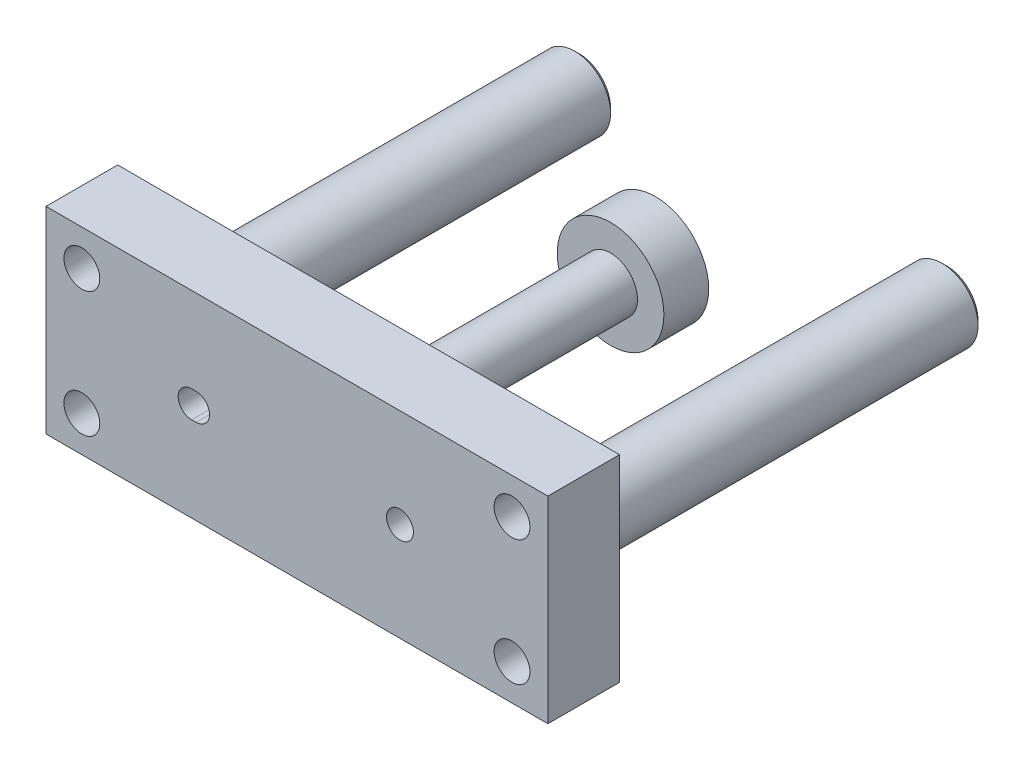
ISO-10303-21;
HEADER;
FILE_DESCRIPTION(('STEP AP214'),'2;1');
FILE_NAME('part.step','',(''),(''),'','','');
FILE_SCHEMA(('AUTOMOTIVE_DESIGN { 1 0 10303 214 1 1 1 1 }'));
ENDSEC;
DATA;
#1=APPLICATION_CONTEXT('core data for automotive mechanical design processes');
#2=APPLICATION_PROTOCOL_DEFINITION('international standard','automotive_design',2000,#1);
#3=PRODUCT_CONTEXT('',#1,'mechanical');
#4=PRODUCT('Part','Part','',(#3));
#5=PRODUCT_RELATED_PRODUCT_CATEGORY('part','',(#4));
#6=PRODUCT_DEFINITION_FORMATION('','',#4);
#7=PRODUCT_DEFINITION_CONTEXT('part definition',#1,'design');
#8=PRODUCT_DEFINITION('design','',#6,#7);
#9=PRODUCT_DEFINITION_SHAPE('','',#8);
#10=(LENGTH_UNIT() NAMED_UNIT(*) SI_UNIT(.MILLI.,.METRE.));
#11=(NAMED_UNIT(*) PLANE_ANGLE_UNIT() SI_UNIT($,.RADIAN.));
#12=(NAMED_UNIT(*) SI_UNIT($,.STERADIAN.) SOLID_ANGLE_UNIT());
#13=UNCERTAINTY_MEASURE_WITH_UNIT(LENGTH_MEASURE(1.E-05),#10,'distance_accuracy_value','');
#14=(GEOMETRIC_REPRESENTATION_CONTEXT(3) GLOBAL_UNCERTAINTY_ASSIGNED_CONTEXT((#13)) GLOBAL_UNIT_ASSIGNED_CONTEXT((#10,
#11,#12)) REPRESENTATION_CONTEXT('',''));
#15=CARTESIAN_POINT('',(0.,0.,0.));
#16=DIRECTION('',(0.,0.,1.));
#17=DIRECTION('',(1.,0.,0.));
#18=AXIS2_PLACEMENT_3D('',#15,#16,#17);
#19=CARTESIAN_POINT('',(-28.,-11.,29.5));
#20=DIRECTION('',(0.,0.,1.));
#21=DIRECTION('',(1.,0.,0.));
#22=AXIS2_PLACEMENT_3D('',#19,#20,#21);
#23=PLANE('',#22);
#24=CARTESIAN_POINT('',(-24.,-7.,29.5));
#25=DIRECTION('',(0.,0.,1.));
#26=DIRECTION('',(1.,0.,0.));
#27=AXIS2_PLACEMENT_3D('',#24,#25,#26);
#28=CIRCLE('',#27,2.);
#29=CARTESIAN_POINT('',(-22.,-7.,29.5));
#30=VERTEX_POINT('',#29);
#31=EDGE_CURVE('E411',#30,#30,#28,.T.);
#32=ORIENTED_EDGE('',*,*,#31,.T.);
#33=EDGE_LOOP('',(#32));
#34=FACE_BOUND('',#33,.T.);
#35=CARTESIAN_POINT('',(24.,-7.,29.5));
#36=DIRECTION('',(0.,0.,1.));
#37=DIRECTION('',(1.,0.,0.));
#38=AXIS2_PLACEMENT_3D('',#35,#36,#37);
#39=CIRCLE('',#38,2.);
#40=CARTESIAN_POINT('',(26.,-7.,29.5));
#41=VERTEX_POINT('',#40);
#42=EDGE_CURVE('E415',#41,#41,#39,.T.);
#43=ORIENTED_EDGE('',*,*,#42,.T.);
#44=EDGE_LOOP('',(#43));
#45=FACE_BOUND('',#44,.T.);
#46=CARTESIAN_POINT('',(-24.,7.,29.5));
#47=DIRECTION('',(0.,0.,1.));
#48=DIRECTION('',(1.,0.,0.));
#49=AXIS2_PLACEMENT_3D('',#46,#47,#48);
#50=CIRCLE('',#49,2.);
#51=CARTESIAN_POINT('',(-22.,7.,29.5));
#52=VERTEX_POINT('',#51);
#53=EDGE_CURVE('E424',#52,#52,#50,.T.);
#54=ORIENTED_EDGE('',*,*,#53,.T.);
#55=EDGE_LOOP('',(#54));
#56=FACE_BOUND('',#55,.T.);
#57=CARTESIAN_POINT('',(24.,7.,29.5));
#58=DIRECTION('',(0.,0.,1.));
#59=DIRECTION('',(1.,0.,0.));
#60=AXIS2_PLACEMENT_3D('',#57,#58,#59);
#61=CIRCLE('',#60,2.);
#62=CARTESIAN_POINT('',(26.,7.,29.5));
#63=VERTEX_POINT('',#62);
#64=EDGE_CURVE('E128',#63,#63,#61,.T.);
#65=ORIENTED_EDGE('',*,*,#64,.T.);
#66=EDGE_LOOP('',(#65));
#67=FACE_BOUND('',#66,.T.);
#68=CARTESIAN_POINT('',(20.5,0.,29.5));
#69=DIRECTION('',(0.,0.,1.));
#70=DIRECTION('',(1.,0.,0.));
#71=AXIS2_PLACEMENT_3D('',#68,#69,#70);
#72=CIRCLE('',#71,4.);
#73=CARTESIAN_POINT('',(24.5,0.,29.5));
#74=VERTEX_POINT('',#73);
#75=EDGE_CURVE('E199',#74,#74,#72,.F.);
#76=ORIENTED_EDGE('',*,*,#75,.F.);
#77=EDGE_LOOP('',(#76));
#78=FACE_BOUND('',#77,.T.);
#79=DIRECTION('',(0.,-1.,0.));
#80=VECTOR('',#79,1.);
#81=CARTESIAN_POINT('',(-28.,11.,29.5));
#82=LINE('',#81,#80);
#83=CARTESIAN_POINT('',(-28.,11.,29.5));
#84=VERTEX_POINT('',#83);
#85=CARTESIAN_POINT('',(-28.,-11.,29.5));
#86=VERTEX_POINT('',#85);
#87=EDGE_CURVE('E161',#84,#86,#82,.T.);
#88=ORIENTED_EDGE('',*,*,#87,.F.);
#89=DIRECTION('',(-1.,0.,0.));
#90=VECTOR('',#89,1.);
#91=CARTESIAN_POINT('',(-28.,11.,29.5));
#92=LINE('',#91,#90);
#93=CARTESIAN_POINT('',(28.,11.,29.5));
#94=VERTEX_POINT('',#93);
#95=EDGE_CURVE('E168',#94,#84,#92,.T.);
#96=ORIENTED_EDGE('',*,*,#95,.F.);
#97=DIRECTION('',(0.,1.,0.));
#98=VECTOR('',#97,1.);
#99=CARTESIAN_POINT('',(28.,11.,29.5));
#100=LINE('',#99,#98);
#101=CARTESIAN_POINT('',(28.,-11.,29.5));
#102=VERTEX_POINT('',#101);
#103=EDGE_CURVE('E166',#102,#94,#100,.T.);
#104=ORIENTED_EDGE('',*,*,#103,.F.);
#105=DIRECTION('',(1.,0.,0.));
#106=VECTOR('',#105,1.);
#107=CARTESIAN_POINT('',(-28.,-11.,29.5));
#108=LINE('',#107,#106);
#109=EDGE_CURVE('E164',#86,#102,#108,.T.);
#110=ORIENTED_EDGE('',*,*,#109,.F.);
#111=EDGE_LOOP('',(#88,#96,#104,#110));
#112=FACE_BOUND('',#111,.T.);
#113=CARTESIAN_POINT('',(0.,0.,29.5));
#114=DIRECTION('',(0.,0.,1.));
#115=DIRECTION('',(1.,0.,0.));
#116=AXIS2_PLACEMENT_3D('',#113,#114,#115);
#117=CIRCLE('',#116,3.);
#118=CARTESIAN_POINT('',(3.,0.,29.5));
#119=VERTEX_POINT('',#118);
#120=EDGE_CURVE('E189',#119,#119,#117,.T.);
#121=ORIENTED_EDGE('',*,*,#120,.T.);
#122=EDGE_LOOP('',(#121));
#123=FACE_BOUND('',#122,.T.);
#124=CARTESIAN_POINT('',(-20.5,0.,29.5));
#125=DIRECTION('',(0.,0.,1.));
#126=DIRECTION('',(1.,0.,0.));
#127=AXIS2_PLACEMENT_3D('',#124,#125,#126);
#128=CIRCLE('',#127,4.);
#129=CARTESIAN_POINT('',(-16.5,0.,29.5));
#130=VERTEX_POINT('',#129);
#131=EDGE_CURVE('E204',#130,#130,#128,.F.);
#132=ORIENTED_EDGE('',*,*,#131,.F.);
#133=EDGE_LOOP('',(#132));
#134=FACE_BOUND('',#133,.T.);
#135=ADVANCED_FACE('F31',(#34,#45,#56,#67,#78,#112,#123,#134),#23,.F.);
#136=CARTESIAN_POINT('',(0.,0.,2.5));
#137=DIRECTION('',(0.,0.,1.));
#138=DIRECTION('',(1.,0.,0.));
#139=AXIS2_PLACEMENT_3D('',#136,#137,#138);
#140=PLANE('',#139);
#141=CARTESIAN_POINT('',(0.,0.,2.5));
#142=DIRECTION('',(0.,0.,1.));
#143=DIRECTION('',(1.,0.,0.));
#144=AXIS2_PLACEMENT_3D('',#141,#142,#143);
#145=CIRCLE('',#144,5.95);
#146=CARTESIAN_POINT('',(5.95,0.,2.5));
#147=VERTEX_POINT('',#146);
#148=EDGE_CURVE('E196',#147,#147,#145,.T.);
#149=ORIENTED_EDGE('',*,*,#148,.T.);
#150=EDGE_LOOP('',(#149));
#151=FACE_BOUND('',#150,.T.);
#152=CARTESIAN_POINT('',(0.,0.,2.5));
#153=DIRECTION('',(0.,0.,1.));
#154=DIRECTION('',(1.,0.,0.));
#155=AXIS2_PLACEMENT_3D('',#152,#153,#154);
#156=CIRCLE('',#155,3.);
#157=CARTESIAN_POINT('',(3.,0.,2.5));
#158=VERTEX_POINT('',#157);
#159=EDGE_CURVE('E192',#158,#158,#156,.F.);
#160=ORIENTED_EDGE('',*,*,#159,.T.);
#161=EDGE_LOOP('',(#160));
#162=FACE_BOUND('',#161,.T.);
#163=ADVANCED_FACE('F238',(#151,#162),#140,.T.);
#164=CARTESIAN_POINT('',(0.,0.,2.5));
#165=DIRECTION('',(0.,0.,-1.));
#166=DIRECTION('',(-1.,0.,0.));
#167=AXIS2_PLACEMENT_3D('',#164,#165,#166);
#168=CYLINDRICAL_SURFACE('',#167,5.95);
#169=ORIENTED_EDGE('',*,*,#148,.F.);
#170=EDGE_LOOP('',(#169));
#171=FACE_BOUND('',#170,.T.);
#172=CARTESIAN_POINT('',(0.,0.,-2.5));
#173=DIRECTION('',(0.,0.,1.));
#174=DIRECTION('',(1.,0.,0.));
#175=AXIS2_PLACEMENT_3D('',#172,#173,#174);
#176=CIRCLE('',#175,5.95);
#177=CARTESIAN_POINT('',(5.95,0.,-2.5));
#178=VERTEX_POINT('',#177);
#179=EDGE_CURVE('E193',#178,#178,#176,.T.);
#180=ORIENTED_EDGE('',*,*,#179,.T.);
#181=EDGE_LOOP('',(#180));
#182=FACE_BOUND('',#181,.T.);
#183=ADVANCED_FACE('F33',(#171,#182),#168,.T.);
#184=CARTESIAN_POINT('',(0.,0.,-2.5));
#185=DIRECTION('',(0.,0.,1.));
#186=DIRECTION('',(1.,0.,0.));
#187=AXIS2_PLACEMENT_3D('',#184,#185,#186);
#188=PLANE('',#187);
#189=ORIENTED_EDGE('',*,*,#179,.F.);
#190=EDGE_LOOP('',(#189));
#191=FACE_BOUND('',#190,.T.);
#192=ADVANCED_FACE('F274',(#191),#188,.F.);
#193=CARTESIAN_POINT('',(0.,0.,37.9852813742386));
#194=DIRECTION('',(0.,0.,-1.));
#195=DIRECTION('',(-1.,0.,0.));
#196=AXIS2_PLACEMENT_3D('',#193,#194,#195);
#197=CYLINDRICAL_SURFACE('',#196,3.);
#198=ORIENTED_EDGE('',*,*,#159,.F.);
#199=EDGE_LOOP('',(#198));
#200=FACE_BOUND('',#199,.T.);
#201=ORIENTED_EDGE('',*,*,#120,.F.);
#202=EDGE_LOOP('',(#201));
#203=FACE_BOUND('',#202,.T.);
#204=ADVANCED_FACE('F270',(#200,#203),#197,.T.);
#205=CARTESIAN_POINT('',(-28.,11.,37.5));
#206=DIRECTION('',(1.,0.,0.));
#207=DIRECTION('',(0.,0.,-1.));
#208=AXIS2_PLACEMENT_3D('',#205,#206,#207);
#209=PLANE('',#208);
#210=ORIENTED_EDGE('',*,*,#87,.T.);
#211=DIRECTION('',(0.,0.,-1.));
#212=VECTOR('',#211,1.);
#213=CARTESIAN_POINT('',(-28.,-11.,37.5));
#214=LINE('',#213,#212);
#215=CARTESIAN_POINT('',(-28.,-11.,37.5));
#216=VERTEX_POINT('',#215);
#217=EDGE_CURVE('E186',#216,#86,#214,.T.);
#218=ORIENTED_EDGE('',*,*,#217,.F.);
#219=DIRECTION('',(0.,-1.,0.));
#220=VECTOR('',#219,1.);
#221=CARTESIAN_POINT('',(-28.,11.,37.5));
#222=LINE('',#221,#220);
#223=CARTESIAN_POINT('',(-28.,11.,37.5));
#224=VERTEX_POINT('',#223);
#225=EDGE_CURVE('E170',#224,#216,#222,.T.);
#226=ORIENTED_EDGE('',*,*,#225,.F.);
#227=DIRECTION('',(0.,0.,-1.));
#228=VECTOR('',#227,1.);
#229=CARTESIAN_POINT('',(-28.,11.,37.5));
#230=LINE('',#229,#228);
#231=EDGE_CURVE('E177',#224,#84,#230,.T.);
#232=ORIENTED_EDGE('',*,*,#231,.T.);
#233=EDGE_LOOP('',(#210,#218,#226,#232));
#234=FACE_BOUND('',#233,.T.);
#235=ADVANCED_FACE('F266',(#234),#209,.F.);
#236=CARTESIAN_POINT('',(-28.,-11.,37.5));
#237=DIRECTION('',(0.,1.,0.));
#238=DIRECTION('',(0.,0.,1.));
#239=AXIS2_PLACEMENT_3D('',#236,#237,#238);
#240=PLANE('',#239);
#241=ORIENTED_EDGE('',*,*,#109,.T.);
#242=DIRECTION('',(0.,0.,-1.));
#243=VECTOR('',#242,1.);
#244=CARTESIAN_POINT('',(28.,-11.,37.5));
#245=LINE('',#244,#243);
#246=CARTESIAN_POINT('',(28.,-11.,37.5));
#247=VERTEX_POINT('',#246);
#248=EDGE_CURVE('E183',#247,#102,#245,.T.);
#249=ORIENTED_EDGE('',*,*,#248,.F.);
#250=DIRECTION('',(1.,0.,0.));
#251=VECTOR('',#250,1.);
#252=CARTESIAN_POINT('',(-28.,-11.,37.5));
#253=LINE('',#252,#251);
#254=EDGE_CURVE('E172',#216,#247,#253,.T.);
#255=ORIENTED_EDGE('',*,*,#254,.F.);
#256=ORIENTED_EDGE('',*,*,#217,.T.);
#257=EDGE_LOOP('',(#241,#249,#255,#256));
#258=FACE_BOUND('',#257,.T.);
#259=ADVANCED_FACE('F262',(#258),#240,.F.);
#260=CARTESIAN_POINT('',(28.,11.,37.5));
#261=DIRECTION('',(-1.,0.,0.));
#262=DIRECTION('',(0.,0.,1.));
#263=AXIS2_PLACEMENT_3D('',#260,#261,#262);
#264=PLANE('',#263);
#265=ORIENTED_EDGE('',*,*,#103,.T.);
#266=DIRECTION('',(0.,0.,-1.));
#267=VECTOR('',#266,1.);
#268=CARTESIAN_POINT('',(28.,11.,37.5));
#269=LINE('',#268,#267);
#270=CARTESIAN_POINT('',(28.,11.,37.5));
#271=VERTEX_POINT('',#270);
#272=EDGE_CURVE('E180',#271,#94,#269,.T.);
#273=ORIENTED_EDGE('',*,*,#272,.F.);
#274=DIRECTION('',(0.,1.,0.));
#275=VECTOR('',#274,1.);
#276=CARTESIAN_POINT('',(28.,11.,37.5));
#277=LINE('',#276,#275);
#278=EDGE_CURVE('E174',#247,#271,#277,.T.);
#279=ORIENTED_EDGE('',*,*,#278,.F.);
#280=ORIENTED_EDGE('',*,*,#248,.T.);
#281=EDGE_LOOP('',(#265,#273,#279,#280));
#282=FACE_BOUND('',#281,.T.);
#283=ADVANCED_FACE('F258',(#282),#264,.F.);
#284=CARTESIAN_POINT('',(-28.,11.,37.5));
#285=DIRECTION('',(0.,-1.,0.));
#286=DIRECTION('',(0.,0.,-1.));
#287=AXIS2_PLACEMENT_3D('',#284,#285,#286);
#288=PLANE('',#287);
#289=ORIENTED_EDGE('',*,*,#95,.T.);
#290=ORIENTED_EDGE('',*,*,#231,.F.);
#291=DIRECTION('',(-1.,0.,0.));
#292=VECTOR('',#291,1.);
#293=CARTESIAN_POINT('',(-28.,11.,37.5));
#294=LINE('',#293,#292);
#295=EDGE_CURVE('E54',#271,#224,#294,.T.);
#296=ORIENTED_EDGE('',*,*,#295,.F.);
#297=ORIENTED_EDGE('',*,*,#272,.T.);
#298=EDGE_LOOP('',(#289,#290,#296,#297));
#299=FACE_BOUND('',#298,.T.);
#300=ADVANCED_FACE('F254',(#299),#288,.F.);
#301=CARTESIAN_POINT('',(-28.,-11.,37.5));
#302=DIRECTION('',(0.,0.,1.));
#303=DIRECTION('',(1.,0.,0.));
#304=AXIS2_PLACEMENT_3D('',#301,#302,#303);
#305=PLANE('',#304);
#306=CARTESIAN_POINT('',(-24.,-7.,37.5));
#307=DIRECTION('',(0.,0.,1.));
#308=DIRECTION('',(-1.,0.,0.));
#309=AXIS2_PLACEMENT_3D('',#306,#307,#308);
#310=CIRCLE('',#309,2.);
#311=CARTESIAN_POINT('',(-22.,-7.,37.5));
#312=VERTEX_POINT('',#311);
#313=EDGE_CURVE('E409',#312,#312,#310,.T.);
#314=ORIENTED_EDGE('',*,*,#313,.F.);
#315=EDGE_LOOP('',(#314));
#316=FACE_BOUND('',#315,.T.);
#317=CARTESIAN_POINT('',(24.,-7.,37.5));
#318=DIRECTION('',(0.,0.,1.));
#319=DIRECTION('',(1.,0.,0.));
#320=AXIS2_PLACEMENT_3D('',#317,#318,#319);
#321=CIRCLE('',#320,2.);
#322=CARTESIAN_POINT('',(26.,-7.,37.5));
#323=VERTEX_POINT('',#322);
#324=EDGE_CURVE('E412',#323,#323,#321,.T.);
#325=ORIENTED_EDGE('',*,*,#324,.F.);
#326=EDGE_LOOP('',(#325));
#327=FACE_BOUND('',#326,.T.);
#328=CARTESIAN_POINT('',(-24.,7.,37.5));
#329=DIRECTION('',(0.,0.,1.));
#330=DIRECTION('',(-1.,0.,0.));
#331=AXIS2_PLACEMENT_3D('',#328,#329,#330);
#332=CIRCLE('',#331,2.);
#333=CARTESIAN_POINT('',(-22.,7.,37.5));
#334=VERTEX_POINT('',#333);
#335=EDGE_CURVE('E421',#334,#334,#332,.T.);
#336=ORIENTED_EDGE('',*,*,#335,.F.);
#337=EDGE_LOOP('',(#336));
#338=FACE_BOUND('',#337,.T.);
#339=CARTESIAN_POINT('',(24.,7.,37.5));
#340=DIRECTION('',(0.,0.,1.));
#341=DIRECTION('',(1.,0.,0.));
#342=AXIS2_PLACEMENT_3D('',#339,#340,#341);
#343=CIRCLE('',#342,2.);
#344=CARTESIAN_POINT('',(26.,7.,37.5));
#345=VERTEX_POINT('',#344);
#346=EDGE_CURVE('E131',#345,#345,#343,.T.);
#347=ORIENTED_EDGE('',*,*,#346,.F.);
#348=EDGE_LOOP('',(#347));
#349=FACE_BOUND('',#348,.T.);
#350=CARTESIAN_POINT('',(-11.25,0.,37.5));
#351=DIRECTION('',(0.,0.,1.));
#352=DIRECTION('',(1.,0.,0.));
#353=AXIS2_PLACEMENT_3D('',#350,#351,#352);
#354=CIRCLE('',#353,1.5);
#355=CARTESIAN_POINT('',(-11.25,-1.5,37.5));
#356=VERTEX_POINT('',#355);
#357=CARTESIAN_POINT('',(-11.25,1.5,37.5));
#358=VERTEX_POINT('',#357);
#359=EDGE_CURVE('E110',#356,#358,#354,.T.);
#360=ORIENTED_EDGE('',*,*,#359,.F.);
#361=DIRECTION('',(1.,0.,0.));
#362=VECTOR('',#361,1.);
#363=CARTESIAN_POINT('',(-11.75,-1.5,37.5));
#364=LINE('',#363,#362);
#365=CARTESIAN_POINT('',(-11.75,-1.5,37.5));
#366=VERTEX_POINT('',#365);
#367=EDGE_CURVE('E136',#366,#356,#364,.T.);
#368=ORIENTED_EDGE('',*,*,#367,.F.);
#369=CARTESIAN_POINT('',(-11.75,0.,37.5));
#370=DIRECTION('',(0.,0.,1.));
#371=DIRECTION('',(1.,0.,0.));
#372=AXIS2_PLACEMENT_3D('',#369,#370,#371);
#373=CIRCLE('',#372,1.5);
#374=CARTESIAN_POINT('',(-11.75,1.5,37.5));
#375=VERTEX_POINT('',#374);
#376=EDGE_CURVE('E112',#375,#366,#373,.T.);
#377=ORIENTED_EDGE('',*,*,#376,.F.);
#378=DIRECTION('',(-1.,0.,0.));
#379=VECTOR('',#378,1.);
#380=CARTESIAN_POINT('',(-11.75,1.5,37.5));
#381=LINE('',#380,#379);
#382=EDGE_CURVE('E104',#358,#375,#381,.T.);
#383=ORIENTED_EDGE('',*,*,#382,.F.);
#384=EDGE_LOOP('',(#360,#368,#377,#383));
#385=FACE_BOUND('',#384,.T.);
#386=CARTESIAN_POINT('',(11.5,0.,37.5));
#387=DIRECTION('',(0.,0.,1.));
#388=DIRECTION('',(1.,0.,0.));
#389=AXIS2_PLACEMENT_3D('',#386,#387,#388);
#390=CIRCLE('',#389,1.5);
#391=CARTESIAN_POINT('',(13.,0.,37.5));
#392=VERTEX_POINT('',#391);
#393=EDGE_CURVE('E155',#392,#392,#390,.T.);
#394=ORIENTED_EDGE('',*,*,#393,.F.);
#395=EDGE_LOOP('',(#394));
#396=FACE_BOUND('',#395,.T.);
#397=ORIENTED_EDGE('',*,*,#225,.T.);
#398=ORIENTED_EDGE('',*,*,#254,.T.);
#399=ORIENTED_EDGE('',*,*,#278,.T.);
#400=ORIENTED_EDGE('',*,*,#295,.T.);
#401=EDGE_LOOP('',(#397,#398,#399,#400));
#402=FACE_BOUND('',#401,.T.);
#403=ADVANCED_FACE('F106',(#316,#327,#338,#349,#385,#396,#402),#305,.T.);
#404=CARTESIAN_POINT('',(20.5,0.,-25.8137084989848));
#405=DIRECTION('',(0.,0.,1.));
#406=DIRECTION('',(1.,0.,0.));
#407=AXIS2_PLACEMENT_3D('',#404,#405,#406);
#408=CYLINDRICAL_SURFACE('',#407,4.);
#409=CARTESIAN_POINT('',(20.5,0.,-14.));
#410=DIRECTION('',(0.,0.,-1.));
#411=DIRECTION('',(-1.,0.,0.));
#412=AXIS2_PLACEMENT_3D('',#409,#410,#411);
#413=CIRCLE('',#412,4.);
#414=CARTESIAN_POINT('',(16.5,0.,-14.));
#415=VERTEX_POINT('',#414);
#416=EDGE_CURVE('E213',#415,#415,#413,.F.);
#417=ORIENTED_EDGE('',*,*,#416,.T.);
#418=EDGE_LOOP('',(#417));
#419=FACE_BOUND('',#418,.T.);
#420=ORIENTED_EDGE('',*,*,#75,.T.);
#421=EDGE_LOOP('',(#420));
#422=FACE_BOUND('',#421,.T.);
#423=ADVANCED_FACE('F253',(#419,#422),#408,.T.);
#424=CARTESIAN_POINT('',(0.,0.,-14.5));
#425=DIRECTION('',(0.,0.,-1.));
#426=DIRECTION('',(-1.,0.,0.));
#427=AXIS2_PLACEMENT_3D('',#424,#425,#426);
#428=PLANE('',#427);
#429=CARTESIAN_POINT('',(20.5,0.,-14.5));
#430=DIRECTION('',(0.,0.,-1.));
#431=DIRECTION('',(-1.,0.,0.));
#432=AXIS2_PLACEMENT_3D('',#429,#430,#431);
#433=CIRCLE('',#432,3.49999999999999);
#434=CARTESIAN_POINT('',(17.,0.,-14.5));
#435=VERTEX_POINT('',#434);
#436=EDGE_CURVE('E210',#435,#435,#433,.T.);
#437=ORIENTED_EDGE('',*,*,#436,.T.);
#438=EDGE_LOOP('',(#437));
#439=FACE_BOUND('',#438,.T.);
#440=ADVANCED_FACE('F249',(#439),#428,.T.);
#441=CARTESIAN_POINT('',(-20.5,0.,-25.8137084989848));
#442=DIRECTION('',(0.,0.,1.));
#443=DIRECTION('',(1.,0.,0.));
#444=AXIS2_PLACEMENT_3D('',#441,#442,#443);
#445=CYLINDRICAL_SURFACE('',#444,4.);
#446=CARTESIAN_POINT('',(-20.5,0.,-14.));
#447=DIRECTION('',(0.,0.,-1.));
#448=DIRECTION('',(-1.,0.,0.));
#449=AXIS2_PLACEMENT_3D('',#446,#447,#448);
#450=CIRCLE('',#449,4.);
#451=CARTESIAN_POINT('',(-24.5,0.,-14.));
#452=VERTEX_POINT('',#451);
#453=EDGE_CURVE('E11',#452,#452,#450,.F.);
#454=ORIENTED_EDGE('',*,*,#453,.T.);
#455=EDGE_LOOP('',(#454));
#456=FACE_BOUND('',#455,.T.);
#457=ORIENTED_EDGE('',*,*,#131,.T.);
#458=EDGE_LOOP('',(#457));
#459=FACE_BOUND('',#458,.T.);
#460=ADVANCED_FACE('F295',(#456,#459),#445,.T.);
#461=CARTESIAN_POINT('',(0.,0.,-14.5));
#462=DIRECTION('',(0.,0.,-1.));
#463=DIRECTION('',(-1.,0.,0.));
#464=AXIS2_PLACEMENT_3D('',#461,#462,#463);
#465=PLANE('',#464);
#466=CARTESIAN_POINT('',(-20.5,0.,-14.5));
#467=DIRECTION('',(0.,0.,-1.));
#468=DIRECTION('',(-1.,0.,0.));
#469=AXIS2_PLACEMENT_3D('',#466,#467,#468);
#470=CIRCLE('',#469,3.49999999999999);
#471=CARTESIAN_POINT('',(-24.,0.,-14.5));
#472=VERTEX_POINT('',#471);
#473=EDGE_CURVE('E39',#472,#472,#470,.T.);
#474=ORIENTED_EDGE('',*,*,#473,.T.);
#475=EDGE_LOOP('',(#474));
#476=FACE_BOUND('',#475,.T.);
#477=ADVANCED_FACE('F218',(#476),#465,.T.);
#478=CARTESIAN_POINT('',(11.5,0.,31.5));
#479=DIRECTION('',(0.,0.,1.));
#480=DIRECTION('',(1.,0.,0.));
#481=AXIS2_PLACEMENT_3D('',#478,#479,#480);
#482=CYLINDRICAL_SURFACE('',#481,1.5);
#483=CARTESIAN_POINT('',(11.5,0.,31.5));
#484=DIRECTION('',(0.,0.,1.));
#485=DIRECTION('',(1.,0.,0.));
#486=AXIS2_PLACEMENT_3D('',#483,#484,#485);
#487=CIRCLE('',#486,1.5);
#488=CARTESIAN_POINT('',(13.,0.,31.5));
#489=VERTEX_POINT('',#488);
#490=EDGE_CURVE('E158',#489,#489,#487,.T.);
#491=ORIENTED_EDGE('',*,*,#490,.F.);
#492=EDGE_LOOP('',(#491));
#493=FACE_BOUND('',#492,.T.);
#494=ORIENTED_EDGE('',*,*,#393,.T.);
#495=EDGE_LOOP('',(#494));
#496=FACE_BOUND('',#495,.T.);
#497=ADVANCED_FACE('F303',(#493,#496),#482,.F.);
#498=CARTESIAN_POINT('',(11.5,0.,31.5));
#499=DIRECTION('',(0.,0.,1.));
#500=DIRECTION('',(1.,0.,0.));
#501=AXIS2_PLACEMENT_3D('',#498,#499,#500);
#502=PLANE('',#501);
#503=ORIENTED_EDGE('',*,*,#490,.T.);
#504=EDGE_LOOP('',(#503));
#505=FACE_BOUND('',#504,.T.);
#506=ADVANCED_FACE('F487',(#505),#502,.T.);
#507=CARTESIAN_POINT('',(-11.75,-1.5,34.5));
#508=DIRECTION('',(0.,-1.,0.));
#509=DIRECTION('',(0.,0.,-1.));
#510=AXIS2_PLACEMENT_3D('',#507,#508,#509);
#511=PLANE('',#510);
#512=ORIENTED_EDGE('',*,*,#367,.T.);
#513=DIRECTION('',(0.,0.,1.));
#514=VECTOR('',#513,1.);
#515=CARTESIAN_POINT('',(-11.25,-1.5,34.5));
#516=LINE('',#515,#514);
#517=CARTESIAN_POINT('',(-11.25,-1.5,34.5));
#518=VERTEX_POINT('',#517);
#519=EDGE_CURVE('E127',#518,#356,#516,.T.);
#520=ORIENTED_EDGE('',*,*,#519,.F.);
#521=DIRECTION('',(1.,0.,0.));
#522=VECTOR('',#521,1.);
#523=CARTESIAN_POINT('',(-11.75,-1.5,34.5));
#524=LINE('',#523,#522);
#525=CARTESIAN_POINT('',(-11.5,-1.5,34.5));
#526=VERTEX_POINT('',#525);
#527=EDGE_CURVE('E145',#526,#518,#524,.T.);
#528=ORIENTED_EDGE('',*,*,#527,.F.);
#529=CARTESIAN_POINT('',(-11.75,-1.5,34.5));
#530=VERTEX_POINT('',#529);
#531=EDGE_CURVE('E122',#530,#526,#524,.T.);
#532=ORIENTED_EDGE('',*,*,#531,.F.);
#533=DIRECTION('',(0.,0.,1.));
#534=VECTOR('',#533,1.);
#535=CARTESIAN_POINT('',(-11.75,-1.5,34.5));
#536=LINE('',#535,#534);
#537=EDGE_CURVE('E150',#530,#366,#536,.T.);
#538=ORIENTED_EDGE('',*,*,#537,.T.);
#539=EDGE_LOOP('',(#512,#520,#528,#532,#538));
#540=FACE_BOUND('',#539,.T.);
#541=ADVANCED_FACE('F496',(#540),#511,.F.);
#542=CARTESIAN_POINT('',(-11.75,1.5,34.5));
#543=DIRECTION('',(0.,1.,0.));
#544=DIRECTION('',(0.,0.,1.));
#545=AXIS2_PLACEMENT_3D('',#542,#543,#544);
#546=PLANE('',#545);
#547=ORIENTED_EDGE('',*,*,#382,.T.);
#548=DIRECTION('',(0.,0.,1.));
#549=VECTOR('',#548,1.);
#550=CARTESIAN_POINT('',(-11.75,1.5,34.5));
#551=LINE('',#550,#549);
#552=CARTESIAN_POINT('',(-11.75,1.5,34.5));
#553=VERTEX_POINT('',#552);
#554=EDGE_CURVE('E121',#553,#375,#551,.T.);
#555=ORIENTED_EDGE('',*,*,#554,.F.);
#556=DIRECTION('',(-1.,0.,0.));
#557=VECTOR('',#556,1.);
#558=CARTESIAN_POINT('',(-11.75,1.5,34.5));
#559=LINE('',#558,#557);
#560=CARTESIAN_POINT('',(-11.5,1.5,34.5));
#561=VERTEX_POINT('',#560);
#562=EDGE_CURVE('E140',#561,#553,#559,.T.);
#563=ORIENTED_EDGE('',*,*,#562,.F.);
#564=CARTESIAN_POINT('',(-11.25,1.5,34.5));
#565=VERTEX_POINT('',#564);
#566=EDGE_CURVE('E46',#565,#561,#559,.T.);
#567=ORIENTED_EDGE('',*,*,#566,.F.);
#568=DIRECTION('',(0.,0.,1.));
#569=VECTOR('',#568,1.);
#570=CARTESIAN_POINT('',(-11.25,1.5,34.5));
#571=LINE('',#570,#569);
#572=EDGE_CURVE('E117',#565,#358,#571,.T.);
#573=ORIENTED_EDGE('',*,*,#572,.T.);
#574=EDGE_LOOP('',(#547,#555,#563,#567,#573));
#575=FACE_BOUND('',#574,.T.);
#576=ADVANCED_FACE('F118',(#575),#546,.F.);
#577=CARTESIAN_POINT('',(-11.25,0.,34.5));
#578=DIRECTION('',(0.,0.,1.));
#579=DIRECTION('',(1.,0.,0.));
#580=AXIS2_PLACEMENT_3D('',#577,#578,#579);
#581=PLANE('',#580);
#582=CARTESIAN_POINT('',(-11.5,0.,34.5));
#583=DIRECTION('',(0.,0.,1.));
#584=DIRECTION('',(1.,0.,0.));
#585=AXIS2_PLACEMENT_3D('',#582,#583,#584);
#586=CIRCLE('',#585,1.5);
#587=EDGE_CURVE('E209',#526,#561,#586,.F.);
#588=ORIENTED_EDGE('',*,*,#587,.T.);
#589=ORIENTED_EDGE('',*,*,#562,.T.);
#590=CARTESIAN_POINT('',(-11.75,0.,34.5));
#591=DIRECTION('',(0.,0.,1.));
#592=DIRECTION('',(1.,0.,0.));
#593=AXIS2_PLACEMENT_3D('',#590,#591,#592);
#594=CIRCLE('',#593,1.5);
#595=EDGE_CURVE('E142',#553,#530,#594,.T.);
#596=ORIENTED_EDGE('',*,*,#595,.T.);
#597=ORIENTED_EDGE('',*,*,#531,.T.);
#598=EDGE_LOOP('',(#588,#589,#596,#597));
#599=FACE_BOUND('',#598,.T.);
#600=ADVANCED_FACE('F527',(#599),#581,.T.);
#601=EDGE_CURVE('E207',#561,#526,#586,.F.);
#602=ORIENTED_EDGE('',*,*,#601,.T.);
#603=ORIENTED_EDGE('',*,*,#527,.T.);
#604=CARTESIAN_POINT('',(-11.25,0.,34.5));
#605=DIRECTION('',(0.,0.,1.));
#606=DIRECTION('',(1.,0.,0.));
#607=AXIS2_PLACEMENT_3D('',#604,#605,#606);
#608=CIRCLE('',#607,1.5);
#609=EDGE_CURVE('E138',#518,#565,#608,.T.);
#610=ORIENTED_EDGE('',*,*,#609,.T.);
#611=ORIENTED_EDGE('',*,*,#566,.T.);
#612=EDGE_LOOP('',(#602,#603,#610,#611));
#613=FACE_BOUND('',#612,.T.);
#614=ADVANCED_FACE('F536',(#613),#581,.T.);
#615=CARTESIAN_POINT('',(-11.25,0.,34.5));
#616=DIRECTION('',(0.,0.,1.));
#617=DIRECTION('',(1.,0.,0.));
#618=AXIS2_PLACEMENT_3D('',#615,#616,#617);
#619=CYLINDRICAL_SURFACE('',#618,1.5);
#620=ORIENTED_EDGE('',*,*,#359,.T.);
#621=ORIENTED_EDGE('',*,*,#572,.F.);
#622=ORIENTED_EDGE('',*,*,#609,.F.);
#623=ORIENTED_EDGE('',*,*,#519,.T.);
#624=EDGE_LOOP('',(#620,#621,#622,#623));
#625=FACE_BOUND('',#624,.T.);
#626=ADVANCED_FACE('F125',(#625),#619,.F.);
#627=CARTESIAN_POINT('',(-11.75,0.,34.5));
#628=DIRECTION('',(0.,0.,1.));
#629=DIRECTION('',(1.,0.,0.));
#630=AXIS2_PLACEMENT_3D('',#627,#628,#629);
#631=CYLINDRICAL_SURFACE('',#630,1.5);
#632=ORIENTED_EDGE('',*,*,#376,.T.);
#633=ORIENTED_EDGE('',*,*,#537,.F.);
#634=ORIENTED_EDGE('',*,*,#595,.F.);
#635=ORIENTED_EDGE('',*,*,#554,.T.);
#636=EDGE_LOOP('',(#632,#633,#634,#635));
#637=FACE_BOUND('',#636,.T.);
#638=ADVANCED_FACE('F507',(#637),#631,.F.);
#639=CARTESIAN_POINT('',(-11.5,0.,31.5));
#640=DIRECTION('',(0.,0.,-1.));
#641=DIRECTION('',(-1.,0.,0.));
#642=AXIS2_PLACEMENT_3D('',#639,#640,#641);
#643=PLANE('',#642);
#644=CARTESIAN_POINT('',(-11.5,0.,31.5));
#645=DIRECTION('',(0.,0.,1.));
#646=DIRECTION('',(-1.,0.,0.));
#647=AXIS2_PLACEMENT_3D('',#644,#645,#646);
#648=CIRCLE('',#647,1.5);
#649=CARTESIAN_POINT('',(-13.,0.,31.5));
#650=VERTEX_POINT('',#649);
#651=EDGE_CURVE('E149',#650,#650,#648,.T.);
#652=ORIENTED_EDGE('',*,*,#651,.T.);
#653=EDGE_LOOP('',(#652));
#654=FACE_BOUND('',#653,.T.);
#655=ADVANCED_FACE('F503',(#654),#643,.F.);
#656=CARTESIAN_POINT('',(-11.5,0.,31.5));
#657=DIRECTION('',(0.,0.,1.));
#658=DIRECTION('',(1.,0.,0.));
#659=AXIS2_PLACEMENT_3D('',#656,#657,#658);
#660=CYLINDRICAL_SURFACE('',#659,1.5);
#661=ORIENTED_EDGE('',*,*,#651,.F.);
#662=EDGE_LOOP('',(#661));
#663=FACE_BOUND('',#662,.T.);
#664=ORIENTED_EDGE('',*,*,#587,.F.);
#665=ORIENTED_EDGE('',*,*,#601,.F.);
#666=EDGE_LOOP('',(#664,#665));
#667=FACE_BOUND('',#666,.T.);
#668=ADVANCED_FACE('F233',(#663,#667),#660,.F.);
#669=CARTESIAN_POINT('',(20.5,0.,-14.5));
#670=DIRECTION('',(0.,0.,1.));
#671=DIRECTION('',(1.,0.,0.));
#672=AXIS2_PLACEMENT_3D('',#669,#670,#671);
#673=CONICAL_SURFACE('',#672,3.49999999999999,0.785398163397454);
#674=ORIENTED_EDGE('',*,*,#416,.F.);
#675=EDGE_LOOP('',(#674));
#676=FACE_BOUND('',#675,.T.);
#677=ORIENTED_EDGE('',*,*,#436,.F.);
#678=EDGE_LOOP('',(#677));
#679=FACE_BOUND('',#678,.T.);
#680=ADVANCED_FACE('F223',(#676,#679),#673,.T.);
#681=CARTESIAN_POINT('',(-20.5,0.,-14.5));
#682=DIRECTION('',(0.,0.,1.));
#683=DIRECTION('',(1.,0.,0.));
#684=AXIS2_PLACEMENT_3D('',#681,#682,#683);
#685=CONICAL_SURFACE('',#684,3.49999999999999,0.785398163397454);
#686=ORIENTED_EDGE('',*,*,#453,.F.);
#687=EDGE_LOOP('',(#686));
#688=FACE_BOUND('',#687,.T.);
#689=ORIENTED_EDGE('',*,*,#473,.F.);
#690=EDGE_LOOP('',(#689));
#691=FACE_BOUND('',#690,.T.);
#692=ADVANCED_FACE('F220',(#688,#691),#685,.T.);
#693=CARTESIAN_POINT('',(24.,7.,-14.5));
#694=DIRECTION('',(0.,0.,1.));
#695=DIRECTION('',(1.,0.,0.));
#696=AXIS2_PLACEMENT_3D('',#693,#694,#695);
#697=CYLINDRICAL_SURFACE('',#696,2.);
#698=CARTESIAN_POINT('',(26.,7.,37.5));
#699=CARTESIAN_POINT('',(26.,7.,37.4166666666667));
#700=CARTESIAN_POINT('',(26.,7.,37.3333333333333));
#701=CARTESIAN_POINT('',(26.,7.,37.1666666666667));
#702=CARTESIAN_POINT('',(26.,7.,37.0833333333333));
#703=CARTESIAN_POINT('',(26.,7.,36.9166666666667));
#704=CARTESIAN_POINT('',(26.,7.,36.8333333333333));
#705=CARTESIAN_POINT('',(26.,7.,36.6666666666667));
#706=CARTESIAN_POINT('',(26.,7.,36.5833333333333));
#707=CARTESIAN_POINT('',(26.,7.,36.4166666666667));
#708=CARTESIAN_POINT('',(26.,7.,36.3333333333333));
#709=CARTESIAN_POINT('',(26.,7.,36.1666666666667));
#710=CARTESIAN_POINT('',(26.,7.,36.0833333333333));
#711=CARTESIAN_POINT('',(26.,7.,35.9166666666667));
#712=CARTESIAN_POINT('',(26.,7.,35.8333333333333));
#713=CARTESIAN_POINT('',(26.,7.,35.6666666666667));
#714=CARTESIAN_POINT('',(26.,7.,35.5833333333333));
#715=CARTESIAN_POINT('',(26.,7.,35.4166666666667));
#716=CARTESIAN_POINT('',(26.,7.,35.3333333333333));
#717=CARTESIAN_POINT('',(26.,7.,35.1666666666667));
#718=CARTESIAN_POINT('',(26.,7.,35.0833333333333));
#719=CARTESIAN_POINT('',(26.,7.,34.9166666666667));
#720=CARTESIAN_POINT('',(26.,7.,34.8333333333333));
#721=CARTESIAN_POINT('',(26.,7.,34.6666666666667));
#722=CARTESIAN_POINT('',(26.,7.,34.5833333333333));
#723=CARTESIAN_POINT('',(26.,7.,34.4166666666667));
#724=CARTESIAN_POINT('',(26.,7.,34.3333333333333));
#725=CARTESIAN_POINT('',(26.,7.,34.1666666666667));
#726=CARTESIAN_POINT('',(26.,7.,34.0833333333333));
#727=CARTESIAN_POINT('',(26.,7.,33.9166666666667));
#728=CARTESIAN_POINT('',(26.,7.,33.8333333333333));
#729=CARTESIAN_POINT('',(26.,7.,33.6666666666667));
#730=CARTESIAN_POINT('',(26.,7.,33.5833333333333));
#731=CARTESIAN_POINT('',(26.,7.,33.4166666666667));
#732=CARTESIAN_POINT('',(26.,7.,33.3333333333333));
#733=CARTESIAN_POINT('',(26.,7.,33.1666666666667));
#734=CARTESIAN_POINT('',(26.,7.,33.0833333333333));
#735=CARTESIAN_POINT('',(26.,7.,32.9166666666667));
#736=CARTESIAN_POINT('',(26.,7.,32.8333333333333));
#737=CARTESIAN_POINT('',(26.,7.,32.6666666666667));
#738=CARTESIAN_POINT('',(26.,7.,32.5833333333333));
#739=CARTESIAN_POINT('',(26.,7.,32.4166666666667));
#740=CARTESIAN_POINT('',(26.,7.,32.3333333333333));
#741=CARTESIAN_POINT('',(26.,7.,32.1666666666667));
#742=CARTESIAN_POINT('',(26.,7.,32.0833333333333));
#743=CARTESIAN_POINT('',(26.,7.,31.9166666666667));
#744=CARTESIAN_POINT('',(26.,7.,31.8333333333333));
#745=CARTESIAN_POINT('',(26.,7.,31.6666666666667));
#746=CARTESIAN_POINT('',(26.,7.,31.5833333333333));
#747=CARTESIAN_POINT('',(26.,7.,31.4166666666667));
#748=CARTESIAN_POINT('',(26.,7.,31.3333333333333));
#749=CARTESIAN_POINT('',(26.,7.,31.1666666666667));
#750=CARTESIAN_POINT('',(26.,7.,31.0833333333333));
#751=CARTESIAN_POINT('',(26.,7.,30.9166666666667));
#752=CARTESIAN_POINT('',(26.,7.,30.8333333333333));
#753=CARTESIAN_POINT('',(26.,7.,30.6666666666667));
#754=CARTESIAN_POINT('',(26.,7.,30.5833333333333));
#755=CARTESIAN_POINT('',(26.,7.,30.4166666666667));
#756=CARTESIAN_POINT('',(26.,7.,30.3333333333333));
#757=CARTESIAN_POINT('',(26.,7.,30.1666666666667));
#758=CARTESIAN_POINT('',(26.,7.,30.0833333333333));
#759=CARTESIAN_POINT('',(26.,7.,29.9166666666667));
#760=CARTESIAN_POINT('',(26.,7.,29.8333333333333));
#761=CARTESIAN_POINT('',(26.,7.,29.6666666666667));
#762=CARTESIAN_POINT('',(26.,7.,29.5833333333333));
#763=CARTESIAN_POINT('',(26.,7.,29.5));
#764=B_SPLINE_CURVE_WITH_KNOTS('',3,(#698,#699,#700,#701,#702,#703,#704,#705,#706,#707,#708,
#709,#710,#711,#712,#713,#714,#715,#716,#717,#718,#719,#720,#721,#722,#723,#724,#725,#726,#727,
#728,#729,#730,#731,#732,#733,#734,#735,#736,#737,#738,#739,#740,#741,#742,#743,#744,#745,#746,
#747,#748,#749,#750,#751,#752,#753,#754,#755,#756,#757,#758,#759,#760,#761,#762,#763),
.UNSPECIFIED.,.F.,.F.,(4,2,2,2,2,2,2,2,2,2,2,2,2,2,2,2,2,2,2,2,2,2,2,2,2,2,2,2,2,2,2,2,4),(0.,
0.25,0.5,0.750000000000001,1.,1.25,1.5,1.75,2.,2.25,2.5,2.75,3.,3.25,3.5,3.75,4.,4.25,4.5,4.75,
5.,5.25,5.50000000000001,5.75000000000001,6.00000000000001,6.25000000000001,6.50000000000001,
6.75000000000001,7.00000000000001,7.25000000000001,7.50000000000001,7.75000000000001,
8.00000000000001),.UNSPECIFIED.);
#765=EDGE_CURVE('BSEAM222',#345,#63,#764,.T.);
#766=ORIENTED_EDGE('',*,*,#346,.T.);
#767=ORIENTED_EDGE('',*,*,#64,.F.);
#768=ORIENTED_EDGE('',*,*,#765,.T.);
#769=ORIENTED_EDGE('',*,*,#765,.F.);
#770=EDGE_LOOP('',(#766,#768,#767,#769));
#771=FACE_BOUND('',#770,.T.);
#772=ADVANCED_FACE('F222',(#771),#697,.F.);
#773=CARTESIAN_POINT('',(-24.,7.,-14.5));
#774=DIRECTION('',(0.,0.,1.));
#775=DIRECTION('',(1.,0.,0.));
#776=AXIS2_PLACEMENT_3D('',#773,#774,#775);
#777=CYLINDRICAL_SURFACE('',#776,2.);
#778=CARTESIAN_POINT('',(-22.,7.,37.5));
#779=CARTESIAN_POINT('',(-22.,7.,37.4166666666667));
#780=CARTESIAN_POINT('',(-22.,7.,37.3333333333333));
#781=CARTESIAN_POINT('',(-22.,7.,37.1666666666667));
#782=CARTESIAN_POINT('',(-22.,7.,37.0833333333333));
#783=CARTESIAN_POINT('',(-22.,7.,36.9166666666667));
#784=CARTESIAN_POINT('',(-22.,7.,36.8333333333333));
#785=CARTESIAN_POINT('',(-22.,7.,36.6666666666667));
#786=CARTESIAN_POINT('',(-22.,7.,36.5833333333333));
#787=CARTESIAN_POINT('',(-22.,7.,36.4166666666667));
#788=CARTESIAN_POINT('',(-22.,7.,36.3333333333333));
#789=CARTESIAN_POINT('',(-22.,7.,36.1666666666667));
#790=CARTESIAN_POINT('',(-22.,7.,36.0833333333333));
#791=CARTESIAN_POINT('',(-22.,7.,35.9166666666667));
#792=CARTESIAN_POINT('',(-22.,7.,35.8333333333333));
#793=CARTESIAN_POINT('',(-22.,7.,35.6666666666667));
#794=CARTESIAN_POINT('',(-22.,7.,35.5833333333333));
#795=CARTESIAN_POINT('',(-22.,7.,35.4166666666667));
#796=CARTESIAN_POINT('',(-22.,7.,35.3333333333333));
#797=CARTESIAN_POINT('',(-22.,7.,35.1666666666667));
#798=CARTESIAN_POINT('',(-22.,7.,35.0833333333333));
#799=CARTESIAN_POINT('',(-22.,7.,34.9166666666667));
#800=CARTESIAN_POINT('',(-22.,7.,34.8333333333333));
#801=CARTESIAN_POINT('',(-22.,7.,34.6666666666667));
#802=CARTESIAN_POINT('',(-22.,7.,34.5833333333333));
#803=CARTESIAN_POINT('',(-22.,7.,34.4166666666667));
#804=CARTESIAN_POINT('',(-22.,7.,34.3333333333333));
#805=CARTESIAN_POINT('',(-22.,7.,34.1666666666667));
#806=CARTESIAN_POINT('',(-22.,7.,34.0833333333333));
#807=CARTESIAN_POINT('',(-22.,7.,33.9166666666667));
#808=CARTESIAN_POINT('',(-22.,7.,33.8333333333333));
#809=CARTESIAN_POINT('',(-22.,7.,33.6666666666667));
#810=CARTESIAN_POINT('',(-22.,7.,33.5833333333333));
#811=CARTESIAN_POINT('',(-22.,7.,33.4166666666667));
#812=CARTESIAN_POINT('',(-22.,7.,33.3333333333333));
#813=CARTESIAN_POINT('',(-22.,7.,33.1666666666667));
#814=CARTESIAN_POINT('',(-22.,7.,33.0833333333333));
#815=CARTESIAN_POINT('',(-22.,7.,32.9166666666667));
#816=CARTESIAN_POINT('',(-22.,7.,32.8333333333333));
#817=CARTESIAN_POINT('',(-22.,7.,32.6666666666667));
#818=CARTESIAN_POINT('',(-22.,7.,32.5833333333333));
#819=CARTESIAN_POINT('',(-22.,7.,32.4166666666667));
#820=CARTESIAN_POINT('',(-22.,7.,32.3333333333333));
#821=CARTESIAN_POINT('',(-22.,7.,32.1666666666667));
#822=CARTESIAN_POINT('',(-22.,7.,32.0833333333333));
#823=CARTESIAN_POINT('',(-22.,7.,31.9166666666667));
#824=CARTESIAN_POINT('',(-22.,7.,31.8333333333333));
#825=CARTESIAN_POINT('',(-22.,7.,31.6666666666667));
#826=CARTESIAN_POINT('',(-22.,7.,31.5833333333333));
#827=CARTESIAN_POINT('',(-22.,7.,31.4166666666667));
#828=CARTESIAN_POINT('',(-22.,7.,31.3333333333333));
#829=CARTESIAN_POINT('',(-22.,7.,31.1666666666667));
#830=CARTESIAN_POINT('',(-22.,7.,31.0833333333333));
#831=CARTESIAN_POINT('',(-22.,7.,30.9166666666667));
#832=CARTESIAN_POINT('',(-22.,7.,30.8333333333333));
#833=CARTESIAN_POINT('',(-22.,7.,30.6666666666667));
#834=CARTESIAN_POINT('',(-22.,7.,30.5833333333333));
#835=CARTESIAN_POINT('',(-22.,7.,30.4166666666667));
#836=CARTESIAN_POINT('',(-22.,7.,30.3333333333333));
#837=CARTESIAN_POINT('',(-22.,7.,30.1666666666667));
#838=CARTESIAN_POINT('',(-22.,7.,30.0833333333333));
#839=CARTESIAN_POINT('',(-22.,7.,29.9166666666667));
#840=CARTESIAN_POINT('',(-22.,7.,29.8333333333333));
#841=CARTESIAN_POINT('',(-22.,7.,29.6666666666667));
#842=CARTESIAN_POINT('',(-22.,7.,29.5833333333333));
#843=CARTESIAN_POINT('',(-22.,7.,29.5));
#844=B_SPLINE_CURVE_WITH_KNOTS('',3,(#778,#779,#780,#781,#782,#783,#784,#785,#786,#787,#788,
#789,#790,#791,#792,#793,#794,#795,#796,#797,#798,#799,#800,#801,#802,#803,#804,#805,#806,#807,
#808,#809,#810,#811,#812,#813,#814,#815,#816,#817,#818,#819,#820,#821,#822,#823,#824,#825,#826,
#827,#828,#829,#830,#831,#832,#833,#834,#835,#836,#837,#838,#839,#840,#841,#842,#843),
.UNSPECIFIED.,.F.,.F.,(4,2,2,2,2,2,2,2,2,2,2,2,2,2,2,2,2,2,2,2,2,2,2,2,2,2,2,2,2,2,2,2,4),(0.,
0.25,0.5,0.750000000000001,1.,1.25,1.5,1.75,2.,2.25,2.5,2.75,3.,3.25,3.5,3.75,4.,4.25,4.5,4.75,
5.,5.25,5.50000000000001,5.75000000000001,6.00000000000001,6.25000000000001,6.50000000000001,
6.75000000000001,7.00000000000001,7.25000000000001,7.50000000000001,7.75000000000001,
8.00000000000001),.UNSPECIFIED.);
#845=EDGE_CURVE('BSEAM230',#334,#52,#844,.T.);
#846=ORIENTED_EDGE('',*,*,#335,.T.);
#847=ORIENTED_EDGE('',*,*,#53,.F.);
#848=ORIENTED_EDGE('',*,*,#845,.T.);
#849=ORIENTED_EDGE('',*,*,#845,.F.);
#850=EDGE_LOOP('',(#846,#848,#847,#849));
#851=FACE_BOUND('',#850,.T.);
#852=ADVANCED_FACE('F230',(#851),#777,.F.);
#853=CARTESIAN_POINT('',(24.,-7.,-14.5));
#854=DIRECTION('',(0.,0.,1.));
#855=DIRECTION('',(1.,0.,0.));
#856=AXIS2_PLACEMENT_3D('',#853,#854,#855);
#857=CYLINDRICAL_SURFACE('',#856,2.);
#858=CARTESIAN_POINT('',(26.,-7.,37.5));
#859=CARTESIAN_POINT('',(26.,-7.,37.4166666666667));
#860=CARTESIAN_POINT('',(26.,-7.,37.3333333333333));
#861=CARTESIAN_POINT('',(26.,-7.,37.1666666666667));
#862=CARTESIAN_POINT('',(26.,-7.,37.0833333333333));
#863=CARTESIAN_POINT('',(26.,-7.,36.9166666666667));
#864=CARTESIAN_POINT('',(26.,-7.,36.8333333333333));
#865=CARTESIAN_POINT('',(26.,-7.,36.6666666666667));
#866=CARTESIAN_POINT('',(26.,-7.,36.5833333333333));
#867=CARTESIAN_POINT('',(26.,-7.,36.4166666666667));
#868=CARTESIAN_POINT('',(26.,-7.,36.3333333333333));
#869=CARTESIAN_POINT('',(26.,-7.,36.1666666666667));
#870=CARTESIAN_POINT('',(26.,-7.,36.0833333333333));
#871=CARTESIAN_POINT('',(26.,-7.,35.9166666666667));
#872=CARTESIAN_POINT('',(26.,-7.,35.8333333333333));
#873=CARTESIAN_POINT('',(26.,-7.,35.6666666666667));
#874=CARTESIAN_POINT('',(26.,-7.,35.5833333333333));
#875=CARTESIAN_POINT('',(26.,-7.,35.4166666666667));
#876=CARTESIAN_POINT('',(26.,-7.,35.3333333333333));
#877=CARTESIAN_POINT('',(26.,-7.,35.1666666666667));
#878=CARTESIAN_POINT('',(26.,-7.,35.0833333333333));
#879=CARTESIAN_POINT('',(26.,-7.,34.9166666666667));
#880=CARTESIAN_POINT('',(26.,-7.,34.8333333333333));
#881=CARTESIAN_POINT('',(26.,-7.,34.6666666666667));
#882=CARTESIAN_POINT('',(26.,-7.,34.5833333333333));
#883=CARTESIAN_POINT('',(26.,-7.,34.4166666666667));
#884=CARTESIAN_POINT('',(26.,-7.,34.3333333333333));
#885=CARTESIAN_POINT('',(26.,-7.,34.1666666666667));
#886=CARTESIAN_POINT('',(26.,-7.,34.0833333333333));
#887=CARTESIAN_POINT('',(26.,-7.,33.9166666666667));
#888=CARTESIAN_POINT('',(26.,-7.,33.8333333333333));
#889=CARTESIAN_POINT('',(26.,-7.,33.6666666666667));
#890=CARTESIAN_POINT('',(26.,-7.,33.5833333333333));
#891=CARTESIAN_POINT('',(26.,-7.,33.4166666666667));
#892=CARTESIAN_POINT('',(26.,-7.,33.3333333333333));
#893=CARTESIAN_POINT('',(26.,-7.,33.1666666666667));
#894=CARTESIAN_POINT('',(26.,-7.,33.0833333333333));
#895=CARTESIAN_POINT('',(26.,-7.,32.9166666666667));
#896=CARTESIAN_POINT('',(26.,-7.,32.8333333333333));
#897=CARTESIAN_POINT('',(26.,-7.,32.6666666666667));
#898=CARTESIAN_POINT('',(26.,-7.,32.5833333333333));
#899=CARTESIAN_POINT('',(26.,-7.,32.4166666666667));
#900=CARTESIAN_POINT('',(26.,-7.,32.3333333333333));
#901=CARTESIAN_POINT('',(26.,-7.,32.1666666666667));
#902=CARTESIAN_POINT('',(26.,-7.,32.0833333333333));
#903=CARTESIAN_POINT('',(26.,-7.,31.9166666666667));
#904=CARTESIAN_POINT('',(26.,-7.,31.8333333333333));
#905=CARTESIAN_POINT('',(26.,-7.,31.6666666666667));
#906=CARTESIAN_POINT('',(26.,-7.,31.5833333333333));
#907=CARTESIAN_POINT('',(26.,-7.,31.4166666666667));
#908=CARTESIAN_POINT('',(26.,-7.,31.3333333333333));
#909=CARTESIAN_POINT('',(26.,-7.,31.1666666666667));
#910=CARTESIAN_POINT('',(26.,-7.,31.0833333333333));
#911=CARTESIAN_POINT('',(26.,-7.,30.9166666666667));
#912=CARTESIAN_POINT('',(26.,-7.,30.8333333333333));
#913=CARTESIAN_POINT('',(26.,-7.,30.6666666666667));
#914=CARTESIAN_POINT('',(26.,-7.,30.5833333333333));
#915=CARTESIAN_POINT('',(26.,-7.,30.4166666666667));
#916=CARTESIAN_POINT('',(26.,-7.,30.3333333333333));
#917=CARTESIAN_POINT('',(26.,-7.,30.1666666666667));
#918=CARTESIAN_POINT('',(26.,-7.,30.0833333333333));
#919=CARTESIAN_POINT('',(26.,-7.,29.9166666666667));
#920=CARTESIAN_POINT('',(26.,-7.,29.8333333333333));
#921=CARTESIAN_POINT('',(26.,-7.,29.6666666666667));
#922=CARTESIAN_POINT('',(26.,-7.,29.5833333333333));
#923=CARTESIAN_POINT('',(26.,-7.,29.5));
#924=B_SPLINE_CURVE_WITH_KNOTS('',3,(#858,#859,#860,#861,#862,#863,#864,#865,#866,#867,#868,
#869,#870,#871,#872,#873,#874,#875,#876,#877,#878,#879,#880,#881,#882,#883,#884,#885,#886,#887,
#888,#889,#890,#891,#892,#893,#894,#895,#896,#897,#898,#899,#900,#901,#902,#903,#904,#905,#906,
#907,#908,#909,#910,#911,#912,#913,#914,#915,#916,#917,#918,#919,#920,#921,#922,#923),
.UNSPECIFIED.,.F.,.F.,(4,2,2,2,2,2,2,2,2,2,2,2,2,2,2,2,2,2,2,2,2,2,2,2,2,2,2,2,2,2,2,2,4),(0.,
0.25,0.5,0.750000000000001,1.,1.25,1.5,1.75,2.,2.25,2.5,2.75,3.,3.25,3.5,3.75,4.,4.25,4.5,4.75,
5.,5.25,5.50000000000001,5.75000000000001,6.00000000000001,6.25000000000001,6.50000000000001,
6.75000000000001,7.00000000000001,7.25000000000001,7.50000000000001,7.75000000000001,
8.00000000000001),.UNSPECIFIED.);
#925=EDGE_CURVE('BSEAM382',#323,#41,#924,.T.);
#926=ORIENTED_EDGE('',*,*,#324,.T.);
#927=ORIENTED_EDGE('',*,*,#42,.F.);
#928=ORIENTED_EDGE('',*,*,#925,.T.);
#929=ORIENTED_EDGE('',*,*,#925,.F.);
#930=EDGE_LOOP('',(#926,#928,#927,#929));
#931=FACE_BOUND('',#930,.T.);
#932=ADVANCED_FACE('F382',(#931),#857,.F.);
#933=CARTESIAN_POINT('',(-24.,-7.,-14.5));
#934=DIRECTION('',(0.,0.,1.));
#935=DIRECTION('',(1.,0.,0.));
#936=AXIS2_PLACEMENT_3D('',#933,#934,#935);
#937=CYLINDRICAL_SURFACE('',#936,2.);
#938=CARTESIAN_POINT('',(-22.,-7.,37.5));
#939=CARTESIAN_POINT('',(-22.,-7.,37.4166666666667));
#940=CARTESIAN_POINT('',(-22.,-7.,37.3333333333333));
#941=CARTESIAN_POINT('',(-22.,-7.,37.1666666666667));
#942=CARTESIAN_POINT('',(-22.,-7.,37.0833333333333));
#943=CARTESIAN_POINT('',(-22.,-7.,36.9166666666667));
#944=CARTESIAN_POINT('',(-22.,-7.,36.8333333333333));
#945=CARTESIAN_POINT('',(-22.,-7.,36.6666666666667));
#946=CARTESIAN_POINT('',(-22.,-7.,36.5833333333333));
#947=CARTESIAN_POINT('',(-22.,-7.,36.4166666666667));
#948=CARTESIAN_POINT('',(-22.,-7.,36.3333333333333));
#949=CARTESIAN_POINT('',(-22.,-7.,36.1666666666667));
#950=CARTESIAN_POINT('',(-22.,-7.,36.0833333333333));
#951=CARTESIAN_POINT('',(-22.,-7.,35.9166666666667));
#952=CARTESIAN_POINT('',(-22.,-7.,35.8333333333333));
#953=CARTESIAN_POINT('',(-22.,-7.,35.6666666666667));
#954=CARTESIAN_POINT('',(-22.,-7.,35.5833333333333));
#955=CARTESIAN_POINT('',(-22.,-7.,35.4166666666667));
#956=CARTESIAN_POINT('',(-22.,-7.,35.3333333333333));
#957=CARTESIAN_POINT('',(-22.,-7.,35.1666666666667));
#958=CARTESIAN_POINT('',(-22.,-7.,35.0833333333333));
#959=CARTESIAN_POINT('',(-22.,-7.,34.9166666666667));
#960=CARTESIAN_POINT('',(-22.,-7.,34.8333333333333));
#961=CARTESIAN_POINT('',(-22.,-7.,34.6666666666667));
#962=CARTESIAN_POINT('',(-22.,-7.,34.5833333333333));
#963=CARTESIAN_POINT('',(-22.,-7.,34.4166666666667));
#964=CARTESIAN_POINT('',(-22.,-7.,34.3333333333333));
#965=CARTESIAN_POINT('',(-22.,-7.,34.1666666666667));
#966=CARTESIAN_POINT('',(-22.,-7.,34.0833333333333));
#967=CARTESIAN_POINT('',(-22.,-7.,33.9166666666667));
#968=CARTESIAN_POINT('',(-22.,-7.,33.8333333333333));
#969=CARTESIAN_POINT('',(-22.,-7.,33.6666666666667));
#970=CARTESIAN_POINT('',(-22.,-7.,33.5833333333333));
#971=CARTESIAN_POINT('',(-22.,-7.,33.4166666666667));
#972=CARTESIAN_POINT('',(-22.,-7.,33.3333333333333));
#973=CARTESIAN_POINT('',(-22.,-7.,33.1666666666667));
#974=CARTESIAN_POINT('',(-22.,-7.,33.0833333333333));
#975=CARTESIAN_POINT('',(-22.,-7.,32.9166666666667));
#976=CARTESIAN_POINT('',(-22.,-7.,32.8333333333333));
#977=CARTESIAN_POINT('',(-22.,-7.,32.6666666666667));
#978=CARTESIAN_POINT('',(-22.,-7.,32.5833333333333));
#979=CARTESIAN_POINT('',(-22.,-7.,32.4166666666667));
#980=CARTESIAN_POINT('',(-22.,-7.,32.3333333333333));
#981=CARTESIAN_POINT('',(-22.,-7.,32.1666666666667));
#982=CARTESIAN_POINT('',(-22.,-7.,32.0833333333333));
#983=CARTESIAN_POINT('',(-22.,-7.,31.9166666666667));
#984=CARTESIAN_POINT('',(-22.,-7.,31.8333333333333));
#985=CARTESIAN_POINT('',(-22.,-7.,31.6666666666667));
#986=CARTESIAN_POINT('',(-22.,-7.,31.5833333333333));
#987=CARTESIAN_POINT('',(-22.,-7.,31.4166666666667));
#988=CARTESIAN_POINT('',(-22.,-7.,31.3333333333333));
#989=CARTESIAN_POINT('',(-22.,-7.,31.1666666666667));
#990=CARTESIAN_POINT('',(-22.,-7.,31.0833333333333));
#991=CARTESIAN_POINT('',(-22.,-7.,30.9166666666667));
#992=CARTESIAN_POINT('',(-22.,-7.,30.8333333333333));
#993=CARTESIAN_POINT('',(-22.,-7.,30.6666666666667));
#994=CARTESIAN_POINT('',(-22.,-7.,30.5833333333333));
#995=CARTESIAN_POINT('',(-22.,-7.,30.4166666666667));
#996=CARTESIAN_POINT('',(-22.,-7.,30.3333333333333));
#997=CARTESIAN_POINT('',(-22.,-7.,30.1666666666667));
#998=CARTESIAN_POINT('',(-22.,-7.,30.0833333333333));
#999=CARTESIAN_POINT('',(-22.,-7.,29.9166666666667));
#1000=CARTESIAN_POINT('',(-22.,-7.,29.8333333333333));
#1001=CARTESIAN_POINT('',(-22.,-7.,29.6666666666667));
#1002=CARTESIAN_POINT('',(-22.,-7.,29.5833333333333));
#1003=CARTESIAN_POINT('',(-22.,-7.,29.5));
#1004=B_SPLINE_CURVE_WITH_KNOTS('',3,(#938,#939,#940,#941,#942,#943,#944,#945,#946,#947,#948,
#949,#950,#951,#952,#953,#954,#955,#956,#957,#958,#959,#960,#961,#962,#963,#964,#965,#966,#967,
#968,#969,#970,#971,#972,#973,#974,#975,#976,#977,#978,#979,#980,#981,#982,#983,#984,#985,#986,
#987,#988,#989,#990,#991,#992,#993,#994,#995,#996,#997,#998,#999,#1000,#1001,#1002,#1003),
.UNSPECIFIED.,.F.,.F.,(4,2,2,2,2,2,2,2,2,2,2,2,2,2,2,2,2,2,2,2,2,2,2,2,2,2,2,2,2,2,2,2,4),(0.,
0.25,0.5,0.750000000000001,1.,1.25,1.5,1.75,2.,2.25,2.5,2.75,3.,3.25,3.5,3.75,4.,4.25,4.5,4.75,
5.,5.25,5.50000000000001,5.75000000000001,6.00000000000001,6.25000000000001,6.50000000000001,
6.75000000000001,7.00000000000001,7.25000000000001,7.50000000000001,7.75000000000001,
8.00000000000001),.UNSPECIFIED.);
#1005=EDGE_CURVE('BSEAM392',#312,#30,#1004,.T.);
#1006=ORIENTED_EDGE('',*,*,#313,.T.);
#1007=ORIENTED_EDGE('',*,*,#31,.F.);
#1008=ORIENTED_EDGE('',*,*,#1005,.T.);
#1009=ORIENTED_EDGE('',*,*,#1005,.F.);
#1010=EDGE_LOOP('',(#1006,#1008,#1007,#1009));
#1011=FACE_BOUND('',#1010,.T.);
#1012=ADVANCED_FACE('F392',(#1011),#937,.F.);
#1013=CLOSED_SHELL('',(#135,#163,#183,#192,#204,#235,#259,#283,#300,#403,#423,#440,#460,#477,
#497,#506,#541,#576,#600,#614,#626,#638,#655,#668,#680,#692,#772,#852,#932,#1012));
#1014=MANIFOLD_SOLID_BREP('B2',#1013);
#1015=ADVANCED_BREP_SHAPE_REPRESENTATION('',(#18,#1014),#14);
#1016=SHAPE_DEFINITION_REPRESENTATION(#9,#1015);
ENDSEC;
END-ISO-10303-21;
